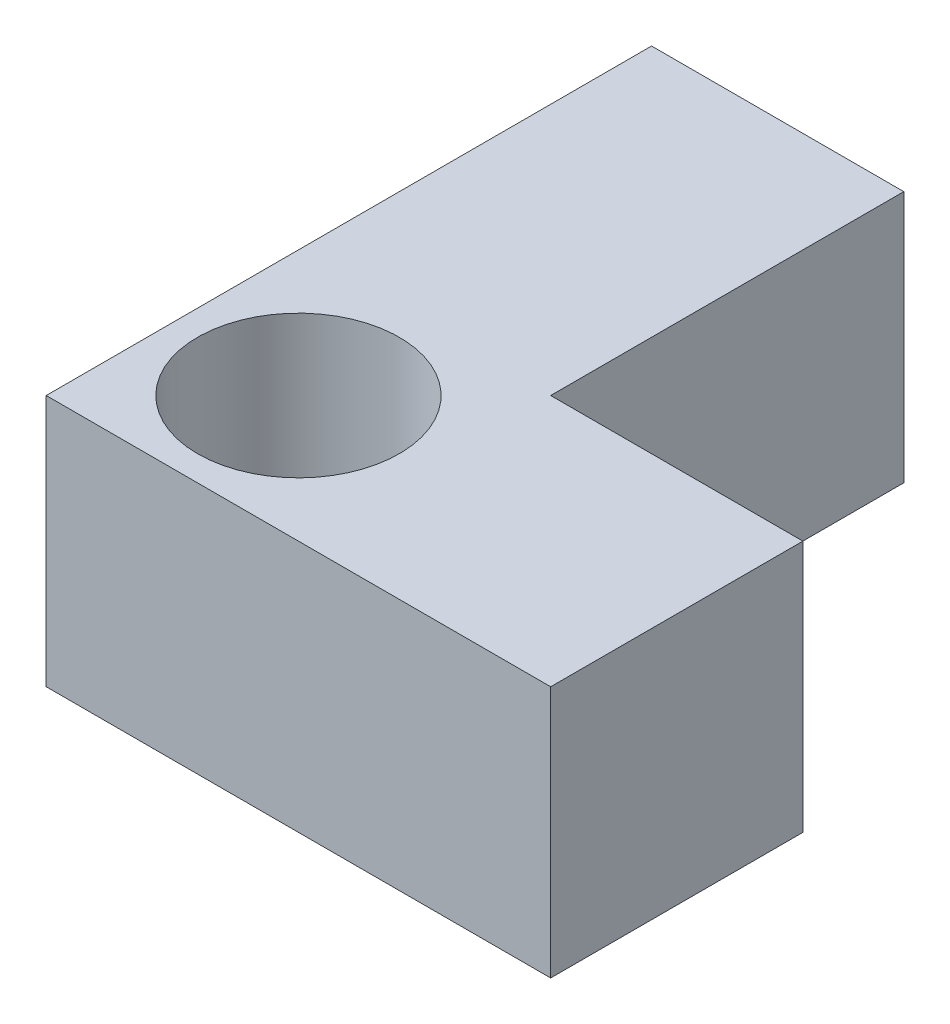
from build123d import *

# Parameters (mm, degrees)
BOSS_EXTRUDE1_DEPTH = 50
SKETCH2_R           = 20
CUT_EXTRUDE1_DEPTH  = 50


with BuildPart() as part:
    # Sketch1 → Boss-Extrude1 (new body)
    with BuildSketch(Plane(origin=(0, 0, 0), x_dir=(1, 0, 0), z_dir=(0, 1, 0))):
        Polygon((0, 0), (0, 120), (50, 120), (50, 50), (100, 50), (100, 0), align=None)
    extrude(amount=BOSS_EXTRUDE1_DEPTH)

    # Sketch2 → Cut-Extrude1 (cut)
    with BuildSketch(Plane(origin=(0, 0, 0), x_dir=(1, 0, 0), z_dir=(0, 1, 0))):
        with Locations(Location((25, 25, 0), (0, 0, 270))):
            Circle(SKETCH2_R)
    extrude(amount=CUT_EXTRUDE1_DEPTH, mode=Mode.SUBTRACT)


solid = part.part
